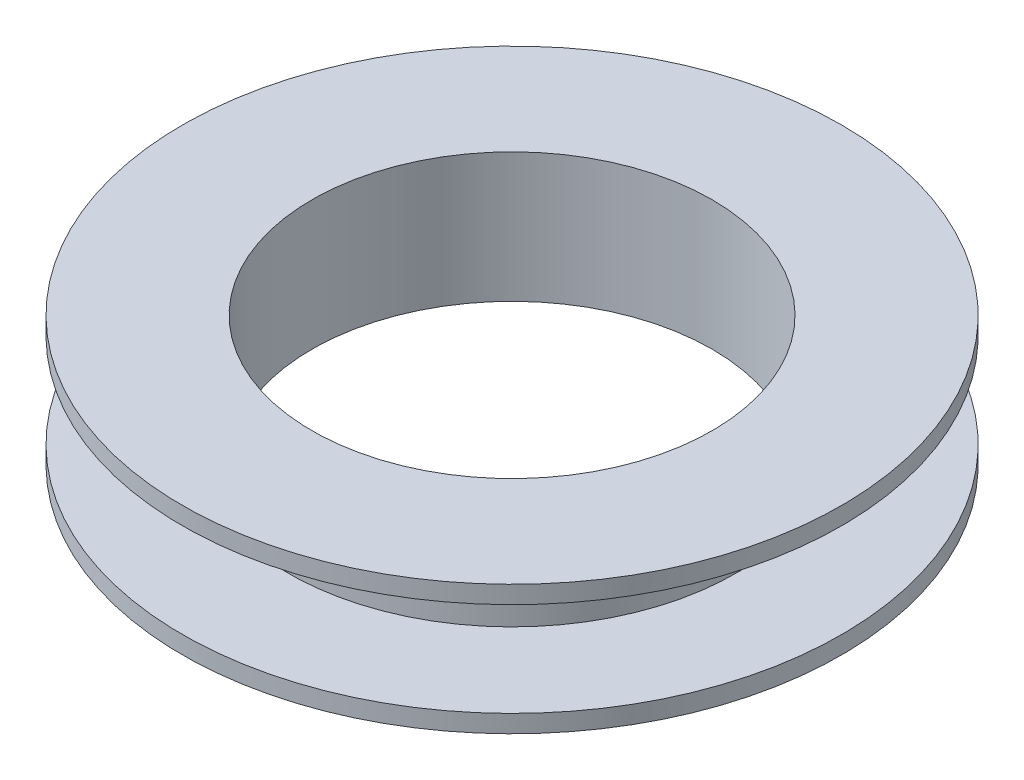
ISO-10303-21;
HEADER;
FILE_DESCRIPTION(('STEP AP214'),'2;1');
FILE_NAME('part.step','',(''),(''),'','','');
FILE_SCHEMA(('AUTOMOTIVE_DESIGN { 1 0 10303 214 1 1 1 1 }'));
ENDSEC;
DATA;
#1=APPLICATION_CONTEXT('core data for automotive mechanical design processes');
#2=APPLICATION_PROTOCOL_DEFINITION('international standard','automotive_design',2000,#1);
#3=PRODUCT_CONTEXT('',#1,'mechanical');
#4=PRODUCT('Part','Part','',(#3));
#5=PRODUCT_RELATED_PRODUCT_CATEGORY('part','',(#4));
#6=PRODUCT_DEFINITION_FORMATION('','',#4);
#7=PRODUCT_DEFINITION_CONTEXT('part definition',#1,'design');
#8=PRODUCT_DEFINITION('design','',#6,#7);
#9=PRODUCT_DEFINITION_SHAPE('','',#8);
#10=(LENGTH_UNIT() NAMED_UNIT(*) SI_UNIT(.MILLI.,.METRE.));
#11=(NAMED_UNIT(*) PLANE_ANGLE_UNIT() SI_UNIT($,.RADIAN.));
#12=(NAMED_UNIT(*) SI_UNIT($,.STERADIAN.) SOLID_ANGLE_UNIT());
#13=UNCERTAINTY_MEASURE_WITH_UNIT(LENGTH_MEASURE(1.E-05),#10,'distance_accuracy_value','');
#14=(GEOMETRIC_REPRESENTATION_CONTEXT(3) GLOBAL_UNCERTAINTY_ASSIGNED_CONTEXT((#13)) GLOBAL_UNIT_ASSIGNED_CONTEXT((#10,
#11,#12)) REPRESENTATION_CONTEXT('',''));
#15=CARTESIAN_POINT('',(0.,0.,0.));
#16=DIRECTION('',(0.,0.,1.));
#17=DIRECTION('',(1.,0.,0.));
#18=AXIS2_PLACEMENT_3D('',#15,#16,#17);
#19=CARTESIAN_POINT('',(-107.95,69.85,0.));
#20=DIRECTION('',(0.,-1.,0.));
#21=DIRECTION('',(0.,0.,-1.));
#22=AXIS2_PLACEMENT_3D('',#19,#20,#21);
#23=PLANE('',#22);
#24=CARTESIAN_POINT('',(0.,69.85,0.));
#25=DIRECTION('',(0.,-1.,0.));
#26=DIRECTION('',(0.,0.,-1.));
#27=AXIS2_PLACEMENT_3D('',#24,#25,#26);
#28=CIRCLE('',#27,177.8);
#29=CARTESIAN_POINT('',(0.,69.85,-177.8));
#30=VERTEX_POINT('',#29);
#31=EDGE_CURVE('E10',#30,#30,#28,.T.);
#32=ORIENTED_EDGE('',*,*,#31,.F.);
#33=EDGE_LOOP('',(#32));
#34=FACE_BOUND('',#33,.T.);
#35=CARTESIAN_POINT('',(0.,69.85,0.));
#36=DIRECTION('',(0.,-1.,0.));
#37=DIRECTION('',(0.,0.,-1.));
#38=AXIS2_PLACEMENT_3D('',#35,#36,#37);
#39=CIRCLE('',#38,107.95);
#40=CARTESIAN_POINT('',(0.,69.85,-107.95));
#41=VERTEX_POINT('',#40);
#42=EDGE_CURVE('E61',#41,#41,#39,.T.);
#43=ORIENTED_EDGE('',*,*,#42,.T.);
#44=EDGE_LOOP('',(#43));
#45=FACE_BOUND('',#44,.T.);
#46=ADVANCED_FACE('F33',(#34,#45),#23,.F.);
#47=CARTESIAN_POINT('',(0.,0.,0.));
#48=DIRECTION('',(0.,-1.,0.));
#49=DIRECTION('',(0.,0.,-1.));
#50=AXIS2_PLACEMENT_3D('',#47,#48,#49);
#51=CYLINDRICAL_SURFACE('',#50,177.8);
#52=CARTESIAN_POINT('',(0.,60.325,0.));
#53=DIRECTION('',(0.,-1.,0.));
#54=DIRECTION('',(0.,0.,-1.));
#55=AXIS2_PLACEMENT_3D('',#52,#53,#54);
#56=CIRCLE('',#55,177.8);
#57=CARTESIAN_POINT('',(0.,60.325,-177.8));
#58=VERTEX_POINT('',#57);
#59=EDGE_CURVE('E39',#58,#58,#56,.T.);
#60=ORIENTED_EDGE('',*,*,#59,.F.);
#61=EDGE_LOOP('',(#60));
#62=FACE_BOUND('',#61,.T.);
#63=ORIENTED_EDGE('',*,*,#31,.T.);
#64=EDGE_LOOP('',(#63));
#65=FACE_BOUND('',#64,.T.);
#66=ADVANCED_FACE('F98',(#62,#65),#51,.T.);
#67=CARTESIAN_POINT('',(-177.8,60.325,0.));
#68=DIRECTION('',(0.,1.,0.));
#69=DIRECTION('',(0.,0.,1.));
#70=AXIS2_PLACEMENT_3D('',#67,#68,#69);
#71=PLANE('',#70);
#72=CARTESIAN_POINT('',(0.,60.325,0.));
#73=DIRECTION('',(0.,-1.,0.));
#74=DIRECTION('',(0.,0.,-1.));
#75=AXIS2_PLACEMENT_3D('',#72,#73,#74);
#76=CIRCLE('',#75,120.65);
#77=CARTESIAN_POINT('',(0.,60.325,-120.65));
#78=VERTEX_POINT('',#77);
#79=EDGE_CURVE('E43',#78,#78,#76,.T.);
#80=ORIENTED_EDGE('',*,*,#79,.F.);
#81=EDGE_LOOP('',(#80));
#82=FACE_BOUND('',#81,.T.);
#83=ORIENTED_EDGE('',*,*,#59,.T.);
#84=EDGE_LOOP('',(#83));
#85=FACE_BOUND('',#84,.T.);
#86=ADVANCED_FACE('F93',(#82,#85),#71,.F.);
#87=CARTESIAN_POINT('',(0.,0.,0.));
#88=DIRECTION('',(0.,-1.,0.));
#89=DIRECTION('',(0.,0.,-1.));
#90=AXIS2_PLACEMENT_3D('',#87,#88,#89);
#91=CYLINDRICAL_SURFACE('',#90,120.65);
#92=CARTESIAN_POINT('',(0.,9.525,0.));
#93=DIRECTION('',(0.,-1.,0.));
#94=DIRECTION('',(0.,0.,-1.));
#95=AXIS2_PLACEMENT_3D('',#92,#93,#94);
#96=CIRCLE('',#95,120.65);
#97=CARTESIAN_POINT('',(0.,9.525,-120.65));
#98=VERTEX_POINT('',#97);
#99=EDGE_CURVE('E47',#98,#98,#96,.T.);
#100=ORIENTED_EDGE('',*,*,#99,.F.);
#101=EDGE_LOOP('',(#100));
#102=FACE_BOUND('',#101,.T.);
#103=ORIENTED_EDGE('',*,*,#79,.T.);
#104=EDGE_LOOP('',(#103));
#105=FACE_BOUND('',#104,.T.);
#106=ADVANCED_FACE('F87',(#102,#105),#91,.T.);
#107=CARTESIAN_POINT('',(-120.65,9.525,0.));
#108=DIRECTION('',(0.,-1.,0.));
#109=DIRECTION('',(0.,0.,-1.));
#110=AXIS2_PLACEMENT_3D('',#107,#108,#109);
#111=PLANE('',#110);
#112=CARTESIAN_POINT('',(0.,9.525,0.));
#113=DIRECTION('',(0.,-1.,0.));
#114=DIRECTION('',(0.,0.,-1.));
#115=AXIS2_PLACEMENT_3D('',#112,#113,#114);
#116=CIRCLE('',#115,177.8);
#117=CARTESIAN_POINT('',(0.,9.525,-177.8));
#118=VERTEX_POINT('',#117);
#119=EDGE_CURVE('E52',#118,#118,#116,.T.);
#120=ORIENTED_EDGE('',*,*,#119,.F.);
#121=EDGE_LOOP('',(#120));
#122=FACE_BOUND('',#121,.T.);
#123=ORIENTED_EDGE('',*,*,#99,.T.);
#124=EDGE_LOOP('',(#123));
#125=FACE_BOUND('',#124,.T.);
#126=ADVANCED_FACE('F81',(#122,#125),#111,.F.);
#127=CARTESIAN_POINT('',(0.,0.,0.));
#128=DIRECTION('',(0.,-1.,0.));
#129=DIRECTION('',(0.,0.,-1.));
#130=AXIS2_PLACEMENT_3D('',#127,#128,#129);
#131=CYLINDRICAL_SURFACE('',#130,177.8);
#132=CARTESIAN_POINT('',(0.,0.,0.));
#133=DIRECTION('',(0.,-1.,0.));
#134=DIRECTION('',(0.,0.,-1.));
#135=AXIS2_PLACEMENT_3D('',#132,#133,#134);
#136=CIRCLE('',#135,177.8);
#137=CARTESIAN_POINT('',(0.,0.,-177.8));
#138=VERTEX_POINT('',#137);
#139=EDGE_CURVE('E55',#138,#138,#136,.T.);
#140=ORIENTED_EDGE('',*,*,#139,.F.);
#141=EDGE_LOOP('',(#140));
#142=FACE_BOUND('',#141,.T.);
#143=ORIENTED_EDGE('',*,*,#119,.T.);
#144=EDGE_LOOP('',(#143));
#145=FACE_BOUND('',#144,.T.);
#146=ADVANCED_FACE('F75',(#142,#145),#131,.T.);
#147=CARTESIAN_POINT('',(-177.8,0.,0.));
#148=DIRECTION('',(0.,1.,0.));
#149=DIRECTION('',(0.,0.,1.));
#150=AXIS2_PLACEMENT_3D('',#147,#148,#149);
#151=PLANE('',#150);
#152=CARTESIAN_POINT('',(0.,0.,0.));
#153=DIRECTION('',(0.,-1.,0.));
#154=DIRECTION('',(0.,0.,-1.));
#155=AXIS2_PLACEMENT_3D('',#152,#153,#154);
#156=CIRCLE('',#155,107.95);
#157=CARTESIAN_POINT('',(0.,0.,-107.95));
#158=VERTEX_POINT('',#157);
#159=EDGE_CURVE('E58',#158,#158,#156,.T.);
#160=ORIENTED_EDGE('',*,*,#159,.F.);
#161=EDGE_LOOP('',(#160));
#162=FACE_BOUND('',#161,.T.);
#163=ORIENTED_EDGE('',*,*,#139,.T.);
#164=EDGE_LOOP('',(#163));
#165=FACE_BOUND('',#164,.T.);
#166=ADVANCED_FACE('F69',(#162,#165),#151,.F.);
#167=CARTESIAN_POINT('',(0.,0.,0.));
#168=DIRECTION('',(0.,-1.,0.));
#169=DIRECTION('',(0.,0.,-1.));
#170=AXIS2_PLACEMENT_3D('',#167,#168,#169);
#171=CYLINDRICAL_SURFACE('',#170,107.95);
#172=ORIENTED_EDGE('',*,*,#42,.F.);
#173=EDGE_LOOP('',(#172));
#174=FACE_BOUND('',#173,.T.);
#175=ORIENTED_EDGE('',*,*,#159,.T.);
#176=EDGE_LOOP('',(#175));
#177=FACE_BOUND('',#176,.T.);
#178=ADVANCED_FACE('F66',(#174,#177),#171,.F.);
#179=CLOSED_SHELL('',(#46,#66,#86,#106,#126,#146,#166,#178));
#180=MANIFOLD_SOLID_BREP('B2',#179);
#181=ADVANCED_BREP_SHAPE_REPRESENTATION('',(#18,#180),#14);
#182=SHAPE_DEFINITION_REPRESENTATION(#9,#181);
ENDSEC;
END-ISO-10303-21;
